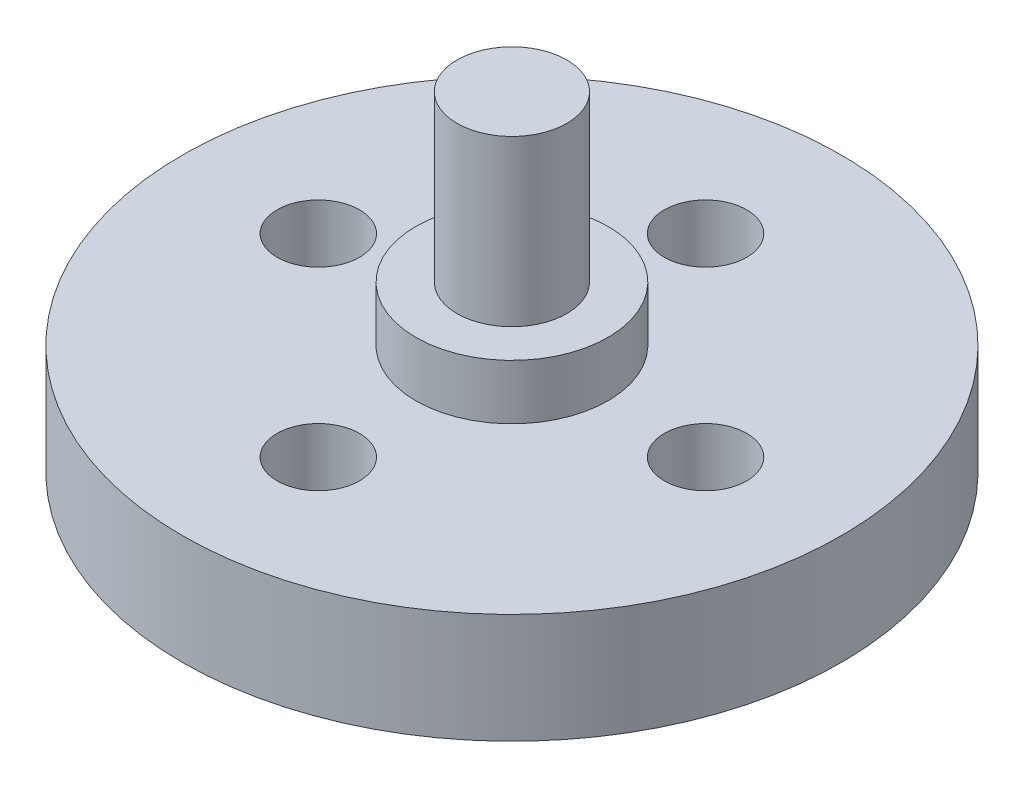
from build123d import *

# Parameters (mm, degrees)
SKETCH_1_R      = 12
SKETCH_1_R_2    = 1.5
EXTRUDE_1_DEPTH = 4
SKETCH_2_R      = 2
EXTRUDE_2_DEPTH = 8
SKETCH_3_R      = 3.5
EXTRUDE_3_DEPTH = 2


with BuildPart() as part:
    # Sketch 1 → Extrude 1 (new body)
    with BuildSketch(Plane(origin=(0, 0, 0), x_dir=(1, 0, 0), z_dir=(0, 1, 0))):
        with Locations(Location((0, 0, 0), (0, 0, 270))):
            Circle(SKETCH_1_R)
        with Locations(Location((0, 7.05, 0), (0, 0, 270))):
            Circle(SKETCH_1_R_2, mode=Mode.SUBTRACT)
        with Locations(Location((7.05, 0, 0), (0, 0, 270))):
            Circle(SKETCH_1_R_2, mode=Mode.SUBTRACT)
        with Locations(Location((0, -7.05, 0), (0, 0, 270))):
            Circle(SKETCH_1_R_2, mode=Mode.SUBTRACT)
        with Locations(Location((-7.05, 0, 0), (0, 0, 270))):
            Circle(SKETCH_1_R_2, mode=Mode.SUBTRACT)
    extrude(amount=EXTRUDE_1_DEPTH)

    # Sketch 2 → Extrude 2 (add)
    with BuildSketch(Plane(origin=(0, 4, 0), x_dir=(1, 0, 0), z_dir=(0, 1, 0))):
        with Locations(Location((0, 0, 0), (0, 0, 270))):
            Circle(SKETCH_2_R)
    extrude(amount=EXTRUDE_2_DEPTH)

    # Sketch 3 → Extrude 3 (add)
    with BuildSketch(Plane(origin=(0, 4, 0), x_dir=(1, 0, 0), z_dir=(0, 1, 0))):
        with Locations(Location((0, 0, 0), (0, 0, 270))):
            Circle(SKETCH_3_R)
    extrude(amount=EXTRUDE_3_DEPTH)


solid = part.part
